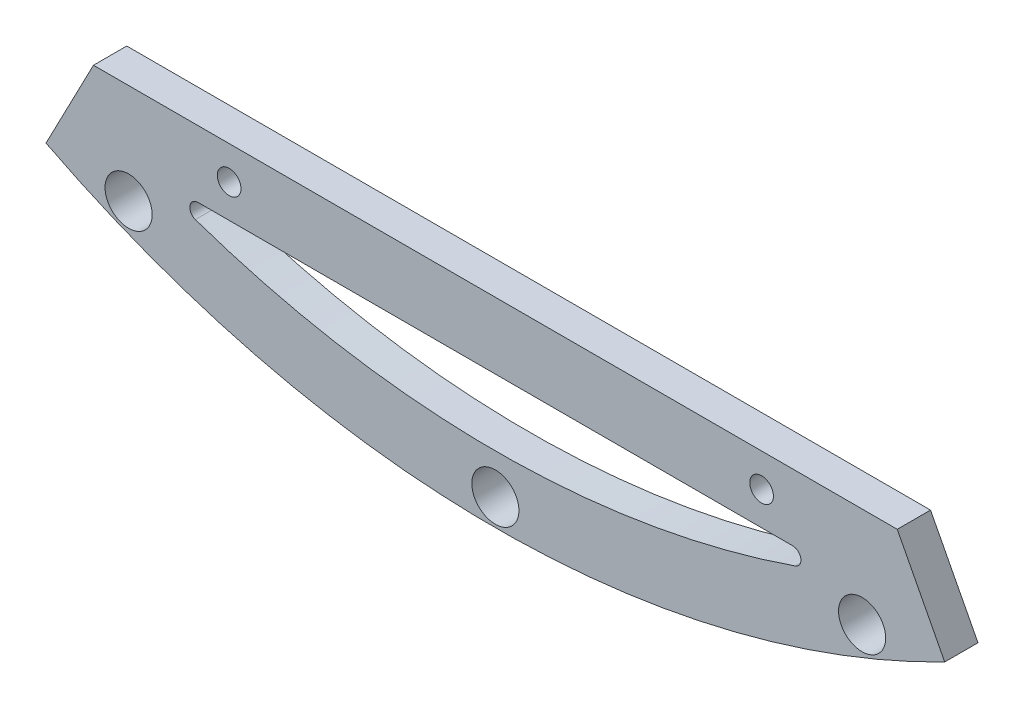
ISO-10303-21;
HEADER;
FILE_DESCRIPTION(('STEP AP214'),'2;1');
FILE_NAME('part.step','',(''),(''),'','','');
FILE_SCHEMA(('AUTOMOTIVE_DESIGN { 1 0 10303 214 1 1 1 1 }'));
ENDSEC;
DATA;
#1=APPLICATION_CONTEXT('core data for automotive mechanical design processes');
#2=APPLICATION_PROTOCOL_DEFINITION('international standard','automotive_design',2000,#1);
#3=PRODUCT_CONTEXT('',#1,'mechanical');
#4=PRODUCT('Part','Part','',(#3));
#5=PRODUCT_RELATED_PRODUCT_CATEGORY('part','',(#4));
#6=PRODUCT_DEFINITION_FORMATION('','',#4);
#7=PRODUCT_DEFINITION_CONTEXT('part definition',#1,'design');
#8=PRODUCT_DEFINITION('design','',#6,#7);
#9=PRODUCT_DEFINITION_SHAPE('','',#8);
#10=(LENGTH_UNIT() NAMED_UNIT(*) SI_UNIT(.MILLI.,.METRE.));
#11=(NAMED_UNIT(*) PLANE_ANGLE_UNIT() SI_UNIT($,.RADIAN.));
#12=(NAMED_UNIT(*) SI_UNIT($,.STERADIAN.) SOLID_ANGLE_UNIT());
#13=UNCERTAINTY_MEASURE_WITH_UNIT(LENGTH_MEASURE(1.E-05),#10,'distance_accuracy_value','');
#14=(GEOMETRIC_REPRESENTATION_CONTEXT(3) GLOBAL_UNCERTAINTY_ASSIGNED_CONTEXT((#13)) GLOBAL_UNIT_ASSIGNED_CONTEXT((#10,
#11,#12)) REPRESENTATION_CONTEXT('',''));
#15=CARTESIAN_POINT('',(0.,0.,0.));
#16=DIRECTION('',(0.,0.,1.));
#17=DIRECTION('',(1.,0.,0.));
#18=AXIS2_PLACEMENT_3D('',#15,#16,#17);
#19=CARTESIAN_POINT('',(0.,0.,3.175));
#20=DIRECTION('',(0.,0.,1.));
#21=DIRECTION('',(1.,0.,0.));
#22=AXIS2_PLACEMENT_3D('',#19,#20,#21);
#23=PLANE('',#22);
#24=CARTESIAN_POINT('',(-25.4,-78.105,3.175));
#25=DIRECTION('',(0.,0.,1.));
#26=DIRECTION('',(1.,0.,0.));
#27=AXIS2_PLACEMENT_3D('',#24,#25,#26);
#28=CIRCLE('',#27,1.1303);
#29=CARTESIAN_POINT('',(-24.2697,-78.105,3.175));
#30=VERTEX_POINT('',#29);
#31=EDGE_CURVE('E240',#30,#30,#28,.T.);
#32=ORIENTED_EDGE('',*,*,#31,.F.);
#33=EDGE_LOOP('',(#32));
#34=FACE_BOUND('',#33,.T.);
#35=CARTESIAN_POINT('',(25.4,-78.105,3.175));
#36=DIRECTION('',(0.,0.,1.));
#37=DIRECTION('',(1.,0.,0.));
#38=AXIS2_PLACEMENT_3D('',#35,#36,#37);
#39=CIRCLE('',#38,1.1303);
#40=CARTESIAN_POINT('',(26.5303,-78.105,3.175));
#41=VERTEX_POINT('',#40);
#42=EDGE_CURVE('E244',#41,#41,#39,.T.);
#43=ORIENTED_EDGE('',*,*,#42,.F.);
#44=EDGE_LOOP('',(#43));
#45=FACE_BOUND('',#44,.T.);
#46=CARTESIAN_POINT('',(34.9925730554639,-84.479544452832,3.175));
#47=DIRECTION('',(0.,0.,-1.));
#48=DIRECTION('',(-1.,0.,0.));
#49=AXIS2_PLACEMENT_3D('',#46,#47,#48);
#50=CIRCLE('',#49,2.2479);
#51=CARTESIAN_POINT('',(32.7446730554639,-84.479544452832,3.175));
#52=VERTEX_POINT('',#51);
#53=EDGE_CURVE('E253',#52,#52,#50,.T.);
#54=ORIENTED_EDGE('',*,*,#53,.T.);
#55=EDGE_LOOP('',(#54));
#56=FACE_BOUND('',#55,.T.);
#57=CARTESIAN_POINT('',(-34.9925730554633,-84.4795444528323,3.175));
#58=DIRECTION('',(0.,0.,-1.));
#59=DIRECTION('',(-1.,0.,0.));
#60=AXIS2_PLACEMENT_3D('',#57,#58,#59);
#61=CIRCLE('',#60,2.2479);
#62=CARTESIAN_POINT('',(-37.2404730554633,-84.4795444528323,3.175));
#63=VERTEX_POINT('',#62);
#64=EDGE_CURVE('E259',#63,#63,#61,.T.);
#65=ORIENTED_EDGE('',*,*,#64,.T.);
#66=EDGE_LOOP('',(#65));
#67=FACE_BOUND('',#66,.T.);
#68=CARTESIAN_POINT('',(0.,-91.44,3.175));
#69=DIRECTION('',(0.,0.,-1.));
#70=DIRECTION('',(-1.,0.,0.));
#71=AXIS2_PLACEMENT_3D('',#68,#69,#70);
#72=CIRCLE('',#71,2.2479);
#73=CARTESIAN_POINT('',(-2.2479,-91.44,3.175));
#74=VERTEX_POINT('',#73);
#75=EDGE_CURVE('E124',#74,#74,#72,.T.);
#76=ORIENTED_EDGE('',*,*,#75,.T.);
#77=EDGE_LOOP('',(#76));
#78=FACE_BOUND('',#77,.T.);
#79=CARTESIAN_POINT('',(0.,0.,3.175));
#80=DIRECTION('',(0.,0.,1.));
#81=DIRECTION('',(1.,0.,0.));
#82=AXIS2_PLACEMENT_3D('',#79,#80,#81);
#83=CIRCLE('',#82,93.98);
#84=CARTESIAN_POINT('',(-42.8741283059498,-83.6304341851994,3.175));
#85=VERTEX_POINT('',#84);
#86=CARTESIAN_POINT('',(42.8741283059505,-83.630434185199,3.175));
#87=VERTEX_POINT('',#86);
#88=EDGE_CURVE('E134',#85,#87,#83,.T.);
#89=ORIENTED_EDGE('',*,*,#88,.T.);
#90=DIRECTION('',(-0.461748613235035,0.887010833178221,0.));
#91=VECTOR('',#90,1.);
#92=CARTESIAN_POINT('',(38.3449689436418,-74.93,3.175));
#93=LINE('',#92,#91);
#94=CARTESIAN_POINT('',(38.3449689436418,-74.93,3.175));
#95=VERTEX_POINT('',#94);
#96=EDGE_CURVE('E137',#87,#95,#93,.T.);
#97=ORIENTED_EDGE('',*,*,#96,.T.);
#98=DIRECTION('',(-1.,0.,0.));
#99=VECTOR('',#98,1.);
#100=CARTESIAN_POINT('',(-38.344968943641,-74.93,3.175));
#101=LINE('',#100,#99);
#102=CARTESIAN_POINT('',(-38.344968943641,-74.93,3.175));
#103=VERTEX_POINT('',#102);
#104=EDGE_CURVE('E140',#95,#103,#101,.T.);
#105=ORIENTED_EDGE('',*,*,#104,.T.);
#106=DIRECTION('',(-0.461748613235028,-0.887010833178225,0.));
#107=VECTOR('',#106,1.);
#108=CARTESIAN_POINT('',(-42.8741283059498,-83.6304341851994,3.175));
#109=LINE('',#108,#107);
#110=EDGE_CURVE('E142',#103,#85,#109,.T.);
#111=ORIENTED_EDGE('',*,*,#110,.T.);
#112=EDGE_LOOP('',(#89,#97,#105,#111));
#113=FACE_BOUND('',#112,.T.);
#114=CARTESIAN_POINT('',(0.,0.,3.175));
#115=DIRECTION('',(0.,0.,1.));
#116=DIRECTION('',(1.,0.,0.));
#117=AXIS2_PLACEMENT_3D('',#114,#115,#116);
#118=CIRCLE('',#117,87.63);
#119=CARTESIAN_POINT('',(-28.6217989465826,-82.8239670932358,3.175));
#120=VERTEX_POINT('',#119);
#121=CARTESIAN_POINT('',(28.6217989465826,-82.8239670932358,3.175));
#122=VERTEX_POINT('',#121);
#123=EDGE_CURVE('E104',#120,#122,#118,.T.);
#124=ORIENTED_EDGE('',*,*,#123,.F.);
#125=CARTESIAN_POINT('',(-28.3625435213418,-82.07375,3.175));
#126=DIRECTION('',(0.,0.,1.));
#127=DIRECTION('',(1.,0.,0.));
#128=AXIS2_PLACEMENT_3D('',#125,#126,#127);
#129=CIRCLE('',#128,0.793749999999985);
#130=CARTESIAN_POINT('',(-28.3625435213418,-81.28,3.175));
#131=VERTEX_POINT('',#130);
#132=EDGE_CURVE('E96',#131,#120,#129,.T.);
#133=ORIENTED_EDGE('',*,*,#132,.F.);
#134=DIRECTION('',(-1.,0.,0.));
#135=VECTOR('',#134,1.);
#136=CARTESIAN_POINT('',(28.3625435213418,-81.28,3.175));
#137=LINE('',#136,#135);
#138=CARTESIAN_POINT('',(28.3625435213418,-81.28,3.175));
#139=VERTEX_POINT('',#138);
#140=EDGE_CURVE('E118',#139,#131,#137,.T.);
#141=ORIENTED_EDGE('',*,*,#140,.F.);
#142=CARTESIAN_POINT('',(28.3625435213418,-82.07375,3.175));
#143=DIRECTION('',(0.,0.,1.));
#144=DIRECTION('',(-1.,0.,0.));
#145=AXIS2_PLACEMENT_3D('',#142,#143,#144);
#146=CIRCLE('',#145,0.793749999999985);
#147=EDGE_CURVE('E116',#122,#139,#146,.T.);
#148=ORIENTED_EDGE('',*,*,#147,.F.);
#149=EDGE_LOOP('',(#124,#133,#141,#148));
#150=FACE_BOUND('',#149,.T.);
#151=ADVANCED_FACE('F31',(#34,#45,#56,#67,#78,#113,#150),#23,.T.);
#152=CARTESIAN_POINT('',(0.,0.,0.));
#153=DIRECTION('',(0.,0.,1.));
#154=DIRECTION('',(1.,0.,0.));
#155=AXIS2_PLACEMENT_3D('',#152,#153,#154);
#156=PLANE('',#155);
#157=CARTESIAN_POINT('',(-25.4,-78.105,0.));
#158=DIRECTION('',(0.,0.,1.));
#159=DIRECTION('',(1.,0.,0.));
#160=AXIS2_PLACEMENT_3D('',#157,#158,#159);
#161=CIRCLE('',#160,1.1303);
#162=CARTESIAN_POINT('',(-24.2697,-78.105,0.));
#163=VERTEX_POINT('',#162);
#164=EDGE_CURVE('E238',#163,#163,#161,.T.);
#165=ORIENTED_EDGE('',*,*,#164,.T.);
#166=EDGE_LOOP('',(#165));
#167=FACE_BOUND('',#166,.T.);
#168=CARTESIAN_POINT('',(25.4,-78.105,0.));
#169=DIRECTION('',(0.,0.,1.));
#170=DIRECTION('',(1.,0.,0.));
#171=AXIS2_PLACEMENT_3D('',#168,#169,#170);
#172=CIRCLE('',#171,1.1303);
#173=CARTESIAN_POINT('',(26.5303,-78.105,0.));
#174=VERTEX_POINT('',#173);
#175=EDGE_CURVE('E241',#174,#174,#172,.T.);
#176=ORIENTED_EDGE('',*,*,#175,.T.);
#177=EDGE_LOOP('',(#176));
#178=FACE_BOUND('',#177,.T.);
#179=CARTESIAN_POINT('',(34.9925730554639,-84.479544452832,0.));
#180=DIRECTION('',(0.,0.,-1.));
#181=DIRECTION('',(-1.,0.,0.));
#182=AXIS2_PLACEMENT_3D('',#179,#180,#181);
#183=CIRCLE('',#182,2.24789999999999);
#184=CARTESIAN_POINT('',(32.7446730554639,-84.479544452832,0.));
#185=VERTEX_POINT('',#184);
#186=EDGE_CURVE('E250',#185,#185,#183,.T.);
#187=ORIENTED_EDGE('',*,*,#186,.F.);
#188=EDGE_LOOP('',(#187));
#189=FACE_BOUND('',#188,.T.);
#190=CARTESIAN_POINT('',(-34.9925730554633,-84.4795444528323,0.));
#191=DIRECTION('',(0.,0.,-1.));
#192=DIRECTION('',(-1.,0.,0.));
#193=AXIS2_PLACEMENT_3D('',#190,#191,#192);
#194=CIRCLE('',#193,2.24789999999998);
#195=CARTESIAN_POINT('',(-37.2404730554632,-84.4795444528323,0.));
#196=VERTEX_POINT('',#195);
#197=EDGE_CURVE('E256',#196,#196,#194,.T.);
#198=ORIENTED_EDGE('',*,*,#197,.F.);
#199=EDGE_LOOP('',(#198));
#200=FACE_BOUND('',#199,.T.);
#201=CARTESIAN_POINT('',(0.,-91.44,0.));
#202=DIRECTION('',(0.,0.,-1.));
#203=DIRECTION('',(-1.,0.,0.));
#204=AXIS2_PLACEMENT_3D('',#201,#202,#203);
#205=CIRCLE('',#204,2.24789999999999);
#206=CARTESIAN_POINT('',(-2.24789999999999,-91.44,0.));
#207=VERTEX_POINT('',#206);
#208=EDGE_CURVE('E262',#207,#207,#205,.T.);
#209=ORIENTED_EDGE('',*,*,#208,.F.);
#210=EDGE_LOOP('',(#209));
#211=FACE_BOUND('',#210,.T.);
#212=CARTESIAN_POINT('',(0.,0.,0.));
#213=DIRECTION('',(0.,0.,1.));
#214=DIRECTION('',(1.,0.,0.));
#215=AXIS2_PLACEMENT_3D('',#212,#213,#214);
#216=CIRCLE('',#215,93.98);
#217=CARTESIAN_POINT('',(-42.8741283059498,-83.6304341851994,0.));
#218=VERTEX_POINT('',#217);
#219=CARTESIAN_POINT('',(42.8741283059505,-83.630434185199,0.));
#220=VERTEX_POINT('',#219);
#221=EDGE_CURVE('E112',#218,#220,#216,.T.);
#222=ORIENTED_EDGE('',*,*,#221,.F.);
#223=DIRECTION('',(-0.461748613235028,-0.887010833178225,0.));
#224=VECTOR('',#223,1.);
#225=CARTESIAN_POINT('',(-42.8741283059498,-83.6304341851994,0.));
#226=LINE('',#225,#224);
#227=CARTESIAN_POINT('',(-38.344968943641,-74.93,0.));
#228=VERTEX_POINT('',#227);
#229=EDGE_CURVE('E138',#228,#218,#226,.T.);
#230=ORIENTED_EDGE('',*,*,#229,.F.);
#231=DIRECTION('',(-1.,0.,0.));
#232=VECTOR('',#231,1.);
#233=CARTESIAN_POINT('',(-38.344968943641,-74.93,0.));
#234=LINE('',#233,#232);
#235=CARTESIAN_POINT('',(38.3449689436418,-74.93,0.));
#236=VERTEX_POINT('',#235);
#237=EDGE_CURVE('E149',#236,#228,#234,.T.);
#238=ORIENTED_EDGE('',*,*,#237,.F.);
#239=DIRECTION('',(-0.461748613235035,0.887010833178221,0.));
#240=VECTOR('',#239,1.);
#241=CARTESIAN_POINT('',(38.3449689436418,-74.93,0.));
#242=LINE('',#241,#240);
#243=EDGE_CURVE('E147',#220,#236,#242,.T.);
#244=ORIENTED_EDGE('',*,*,#243,.F.);
#245=EDGE_LOOP('',(#222,#230,#238,#244));
#246=FACE_BOUND('',#245,.T.);
#247=CARTESIAN_POINT('',(-28.3625435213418,-82.07375,0.));
#248=DIRECTION('',(0.,0.,1.));
#249=DIRECTION('',(1.,0.,0.));
#250=AXIS2_PLACEMENT_3D('',#247,#248,#249);
#251=CIRCLE('',#250,0.793749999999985);
#252=CARTESIAN_POINT('',(-28.3625435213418,-81.28,0.));
#253=VERTEX_POINT('',#252);
#254=CARTESIAN_POINT('',(-28.6217989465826,-82.8239670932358,0.));
#255=VERTEX_POINT('',#254);
#256=EDGE_CURVE('E54',#253,#255,#251,.T.);
#257=ORIENTED_EDGE('',*,*,#256,.T.);
#258=CARTESIAN_POINT('',(0.,0.,0.));
#259=DIRECTION('',(0.,0.,1.));
#260=DIRECTION('',(1.,0.,0.));
#261=AXIS2_PLACEMENT_3D('',#258,#259,#260);
#262=CIRCLE('',#261,87.63);
#263=CARTESIAN_POINT('',(28.6217989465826,-82.8239670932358,0.));
#264=VERTEX_POINT('',#263);
#265=EDGE_CURVE('E111',#255,#264,#262,.T.);
#266=ORIENTED_EDGE('',*,*,#265,.T.);
#267=CARTESIAN_POINT('',(28.3625435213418,-82.07375,0.));
#268=DIRECTION('',(0.,0.,1.));
#269=DIRECTION('',(-1.,0.,0.));
#270=AXIS2_PLACEMENT_3D('',#267,#268,#269);
#271=CIRCLE('',#270,0.793749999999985);
#272=CARTESIAN_POINT('',(28.3625435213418,-81.28,0.));
#273=VERTEX_POINT('',#272);
#274=EDGE_CURVE('E126',#264,#273,#271,.T.);
#275=ORIENTED_EDGE('',*,*,#274,.T.);
#276=DIRECTION('',(-1.,0.,0.));
#277=VECTOR('',#276,1.);
#278=CARTESIAN_POINT('',(28.3625435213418,-81.28,0.));
#279=LINE('',#278,#277);
#280=EDGE_CURVE('E105',#273,#253,#279,.T.);
#281=ORIENTED_EDGE('',*,*,#280,.T.);
#282=EDGE_LOOP('',(#257,#266,#275,#281));
#283=FACE_BOUND('',#282,.T.);
#284=ADVANCED_FACE('F167',(#167,#178,#189,#200,#211,#246,#283),#156,.F.);
#285=CARTESIAN_POINT('',(0.,0.,3.175));
#286=DIRECTION('',(0.,0.,-1.));
#287=DIRECTION('',(-1.,0.,0.));
#288=AXIS2_PLACEMENT_3D('',#285,#286,#287);
#289=CYLINDRICAL_SURFACE('',#288,93.98);
#290=ORIENTED_EDGE('',*,*,#221,.T.);
#291=DIRECTION('',(0.,0.,-1.));
#292=VECTOR('',#291,1.);
#293=CARTESIAN_POINT('',(42.8741283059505,-83.630434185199,3.175));
#294=LINE('',#293,#292);
#295=EDGE_CURVE('E11',#87,#220,#294,.T.);
#296=ORIENTED_EDGE('',*,*,#295,.F.);
#297=ORIENTED_EDGE('',*,*,#88,.F.);
#298=DIRECTION('',(0.,0.,-1.));
#299=VECTOR('',#298,1.);
#300=CARTESIAN_POINT('',(-42.8741283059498,-83.6304341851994,3.175));
#301=LINE('',#300,#299);
#302=EDGE_CURVE('E144',#85,#218,#301,.T.);
#303=ORIENTED_EDGE('',*,*,#302,.T.);
#304=EDGE_LOOP('',(#290,#296,#297,#303));
#305=FACE_BOUND('',#304,.T.);
#306=ADVANCED_FACE('F33',(#305),#289,.T.);
#307=CARTESIAN_POINT('',(38.3449689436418,-74.93,3.175));
#308=DIRECTION('',(-0.887010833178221,-0.461748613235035,0.));
#309=DIRECTION('',(0.461748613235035,-0.887010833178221,0.));
#310=AXIS2_PLACEMENT_3D('',#307,#308,#309);
#311=PLANE('',#310);
#312=ORIENTED_EDGE('',*,*,#243,.T.);
#313=DIRECTION('',(0.,0.,-1.));
#314=VECTOR('',#313,1.);
#315=CARTESIAN_POINT('',(38.3449689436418,-74.93,3.175));
#316=LINE('',#315,#314);
#317=EDGE_CURVE('E39',#95,#236,#316,.T.);
#318=ORIENTED_EDGE('',*,*,#317,.F.);
#319=ORIENTED_EDGE('',*,*,#96,.F.);
#320=ORIENTED_EDGE('',*,*,#295,.T.);
#321=EDGE_LOOP('',(#312,#318,#319,#320));
#322=FACE_BOUND('',#321,.T.);
#323=ADVANCED_FACE('F177',(#322),#311,.F.);
#324=CARTESIAN_POINT('',(-38.344968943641,-74.93,3.175));
#325=DIRECTION('',(0.,-1.,0.));
#326=DIRECTION('',(0.,0.,-1.));
#327=AXIS2_PLACEMENT_3D('',#324,#325,#326);
#328=PLANE('',#327);
#329=ORIENTED_EDGE('',*,*,#237,.T.);
#330=DIRECTION('',(0.,0.,-1.));
#331=VECTOR('',#330,1.);
#332=CARTESIAN_POINT('',(-38.344968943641,-74.93,3.175));
#333=LINE('',#332,#331);
#334=EDGE_CURVE('E154',#103,#228,#333,.T.);
#335=ORIENTED_EDGE('',*,*,#334,.F.);
#336=ORIENTED_EDGE('',*,*,#104,.F.);
#337=ORIENTED_EDGE('',*,*,#317,.T.);
#338=EDGE_LOOP('',(#329,#335,#336,#337));
#339=FACE_BOUND('',#338,.T.);
#340=ADVANCED_FACE('F161',(#339),#328,.F.);
#341=CARTESIAN_POINT('',(-42.8741283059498,-83.6304341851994,3.175));
#342=DIRECTION('',(0.887010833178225,-0.461748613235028,0.));
#343=DIRECTION('',(0.461748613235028,0.887010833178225,0.));
#344=AXIS2_PLACEMENT_3D('',#341,#342,#343);
#345=PLANE('',#344);
#346=ORIENTED_EDGE('',*,*,#229,.T.);
#347=ORIENTED_EDGE('',*,*,#302,.F.);
#348=ORIENTED_EDGE('',*,*,#110,.F.);
#349=ORIENTED_EDGE('',*,*,#334,.T.);
#350=EDGE_LOOP('',(#346,#347,#348,#349));
#351=FACE_BOUND('',#350,.T.);
#352=ADVANCED_FACE('F171',(#351),#345,.F.);
#353=CARTESIAN_POINT('',(-28.3625435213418,-82.07375,3.175));
#354=DIRECTION('',(0.,0.,-1.));
#355=DIRECTION('',(-1.,0.,0.));
#356=AXIS2_PLACEMENT_3D('',#353,#354,#355);
#357=CYLINDRICAL_SURFACE('',#356,0.793749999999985);
#358=ORIENTED_EDGE('',*,*,#256,.F.);
#359=DIRECTION('',(0.,0.,-1.));
#360=VECTOR('',#359,1.);
#361=CARTESIAN_POINT('',(-28.3625435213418,-81.28,3.175));
#362=LINE('',#361,#360);
#363=EDGE_CURVE('E100',#131,#253,#362,.T.);
#364=ORIENTED_EDGE('',*,*,#363,.F.);
#365=ORIENTED_EDGE('',*,*,#132,.T.);
#366=DIRECTION('',(0.,0.,-1.));
#367=VECTOR('',#366,1.);
#368=CARTESIAN_POINT('',(-28.6217989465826,-82.8239670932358,3.175));
#369=LINE('',#368,#367);
#370=EDGE_CURVE('E99',#120,#255,#369,.T.);
#371=ORIENTED_EDGE('',*,*,#370,.T.);
#372=EDGE_LOOP('',(#358,#364,#365,#371));
#373=FACE_BOUND('',#372,.T.);
#374=ADVANCED_FACE('F98',(#373),#357,.F.);
#375=CARTESIAN_POINT('',(0.,0.,3.175));
#376=DIRECTION('',(0.,0.,-1.));
#377=DIRECTION('',(-1.,0.,0.));
#378=AXIS2_PLACEMENT_3D('',#375,#376,#377);
#379=CYLINDRICAL_SURFACE('',#378,87.63);
#380=ORIENTED_EDGE('',*,*,#265,.F.);
#381=ORIENTED_EDGE('',*,*,#370,.F.);
#382=ORIENTED_EDGE('',*,*,#123,.T.);
#383=DIRECTION('',(0.,0.,-1.));
#384=VECTOR('',#383,1.);
#385=CARTESIAN_POINT('',(28.6217989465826,-82.8239670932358,3.175));
#386=LINE('',#385,#384);
#387=EDGE_CURVE('E113',#122,#264,#386,.T.);
#388=ORIENTED_EDGE('',*,*,#387,.T.);
#389=EDGE_LOOP('',(#380,#381,#382,#388));
#390=FACE_BOUND('',#389,.T.);
#391=ADVANCED_FACE('F108',(#390),#379,.F.);
#392=CARTESIAN_POINT('',(28.3625435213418,-82.07375,3.175));
#393=DIRECTION('',(0.,0.,-1.));
#394=DIRECTION('',(-1.,0.,0.));
#395=AXIS2_PLACEMENT_3D('',#392,#393,#394);
#396=CYLINDRICAL_SURFACE('',#395,0.793749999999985);
#397=ORIENTED_EDGE('',*,*,#274,.F.);
#398=ORIENTED_EDGE('',*,*,#387,.F.);
#399=ORIENTED_EDGE('',*,*,#147,.T.);
#400=DIRECTION('',(0.,0.,-1.));
#401=VECTOR('',#400,1.);
#402=CARTESIAN_POINT('',(28.3625435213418,-81.28,3.175));
#403=LINE('',#402,#401);
#404=EDGE_CURVE('E46',#139,#273,#403,.T.);
#405=ORIENTED_EDGE('',*,*,#404,.T.);
#406=EDGE_LOOP('',(#397,#398,#399,#405));
#407=FACE_BOUND('',#406,.T.);
#408=ADVANCED_FACE('F204',(#407),#396,.F.);
#409=CARTESIAN_POINT('',(28.3625435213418,-81.28,3.175));
#410=DIRECTION('',(0.,-1.,0.));
#411=DIRECTION('',(0.,0.,-1.));
#412=AXIS2_PLACEMENT_3D('',#409,#410,#411);
#413=PLANE('',#412);
#414=ORIENTED_EDGE('',*,*,#280,.F.);
#415=ORIENTED_EDGE('',*,*,#404,.F.);
#416=ORIENTED_EDGE('',*,*,#140,.T.);
#417=ORIENTED_EDGE('',*,*,#363,.T.);
#418=EDGE_LOOP('',(#414,#415,#416,#417));
#419=FACE_BOUND('',#418,.T.);
#420=ADVANCED_FACE('F208',(#419),#413,.T.);
#421=CARTESIAN_POINT('',(0.,-91.44,0.));
#422=DIRECTION('',(0.,0.,-1.));
#423=DIRECTION('',(-1.,0.,0.));
#424=AXIS2_PLACEMENT_3D('',#421,#422,#423);
#425=CYLINDRICAL_SURFACE('',#424,2.24789999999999);
#426=ORIENTED_EDGE('',*,*,#75,.F.);
#427=EDGE_LOOP('',(#426));
#428=FACE_BOUND('',#427,.T.);
#429=ORIENTED_EDGE('',*,*,#208,.T.);
#430=EDGE_LOOP('',(#429));
#431=FACE_BOUND('',#430,.T.);
#432=ADVANCED_FACE('F214',(#428,#431),#425,.F.);
#433=CARTESIAN_POINT('',(-34.9925730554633,-84.4795444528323,0.));
#434=DIRECTION('',(0.,0.,-1.));
#435=DIRECTION('',(-1.,0.,0.));
#436=AXIS2_PLACEMENT_3D('',#433,#434,#435);
#437=CYLINDRICAL_SURFACE('',#436,2.24789999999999);
#438=ORIENTED_EDGE('',*,*,#64,.F.);
#439=EDGE_LOOP('',(#438));
#440=FACE_BOUND('',#439,.T.);
#441=ORIENTED_EDGE('',*,*,#197,.T.);
#442=EDGE_LOOP('',(#441));
#443=FACE_BOUND('',#442,.T.);
#444=ADVANCED_FACE('F217',(#440,#443),#437,.F.);
#445=CARTESIAN_POINT('',(34.9925730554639,-84.479544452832,0.));
#446=DIRECTION('',(0.,0.,-1.));
#447=DIRECTION('',(-1.,0.,0.));
#448=AXIS2_PLACEMENT_3D('',#445,#446,#447);
#449=CYLINDRICAL_SURFACE('',#448,2.24789999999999);
#450=ORIENTED_EDGE('',*,*,#53,.F.);
#451=EDGE_LOOP('',(#450));
#452=FACE_BOUND('',#451,.T.);
#453=ORIENTED_EDGE('',*,*,#186,.T.);
#454=EDGE_LOOP('',(#453));
#455=FACE_BOUND('',#454,.T.);
#456=ADVANCED_FACE('F221',(#452,#455),#449,.F.);
#457=CARTESIAN_POINT('',(25.4,-78.105,3.175));
#458=DIRECTION('',(0.,0.,1.));
#459=DIRECTION('',(1.,0.,0.));
#460=AXIS2_PLACEMENT_3D('',#457,#458,#459);
#461=CYLINDRICAL_SURFACE('',#460,1.1303);
#462=ORIENTED_EDGE('',*,*,#175,.F.);
#463=EDGE_LOOP('',(#462));
#464=FACE_BOUND('',#463,.T.);
#465=ORIENTED_EDGE('',*,*,#42,.T.);
#466=EDGE_LOOP('',(#465));
#467=FACE_BOUND('',#466,.T.);
#468=ADVANCED_FACE('F225',(#464,#467),#461,.F.);
#469=CARTESIAN_POINT('',(-25.4,-78.105,3.175));
#470=DIRECTION('',(0.,0.,1.));
#471=DIRECTION('',(1.,0.,0.));
#472=AXIS2_PLACEMENT_3D('',#469,#470,#471);
#473=CYLINDRICAL_SURFACE('',#472,1.1303);
#474=ORIENTED_EDGE('',*,*,#164,.F.);
#475=EDGE_LOOP('',(#474));
#476=FACE_BOUND('',#475,.T.);
#477=ORIENTED_EDGE('',*,*,#31,.T.);
#478=EDGE_LOOP('',(#477));
#479=FACE_BOUND('',#478,.T.);
#480=ADVANCED_FACE('F229',(#476,#479),#473,.F.);
#481=CLOSED_SHELL('',(#151,#284,#306,#323,#340,#352,#374,#391,#408,#420,#432,#444,#456,#468,#480));
#482=MANIFOLD_SOLID_BREP('B2',#481);
#483=ADVANCED_BREP_SHAPE_REPRESENTATION('',(#18,#482),#14);
#484=SHAPE_DEFINITION_REPRESENTATION(#9,#483);
ENDSEC;
END-ISO-10303-21;
